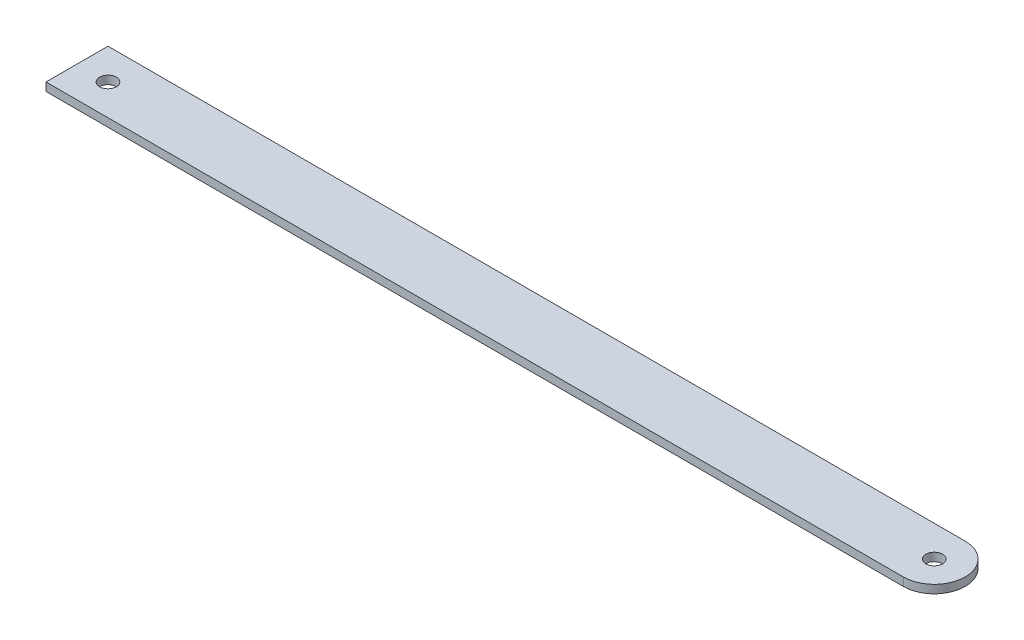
from build123d import *

# Parameters (mm, degrees)
SCHIZZO2_R                   = 4.05
ESTRUSIONE_ESTRUSIONE1_DEPTH = 4


with BuildPart() as part:
    # Schizzo2 → Estrusione-Estrusione1 (new body)
    with BuildSketch(Plane(origin=(0, 0, 0), x_dir=(1, 0, 0), z_dir=(0, 1, 0))):
        with BuildLine():
            Line((2063.19961801, 1790.27482916), (1648.19961801, 1790.27482916))
            Line((1648.19961801, 1790.27482916), (1648.19961801, 1760.27482916))
            Line((1648.19961801, 1760.27482916), (2063.19961801, 1760.27482916))
            ThreePointArc((2063.19961801, 1760.27482916), (2078.19961801, 1775.27482916), (2063.19961801, 1790.27482916))
        make_face()
        with Locations(Location((2063.19961801, 1775.27482916, 0), (0, 0, 270))):
            Circle(SCHIZZO2_R, mode=Mode.SUBTRACT)
        with Locations(Location((1663.19961801, 1775.27482916, 0), (0, 0, 270))):
            Circle(SCHIZZO2_R, mode=Mode.SUBTRACT)
    extrude(amount=ESTRUSIONE_ESTRUSIONE1_DEPTH)


solid = part.part
